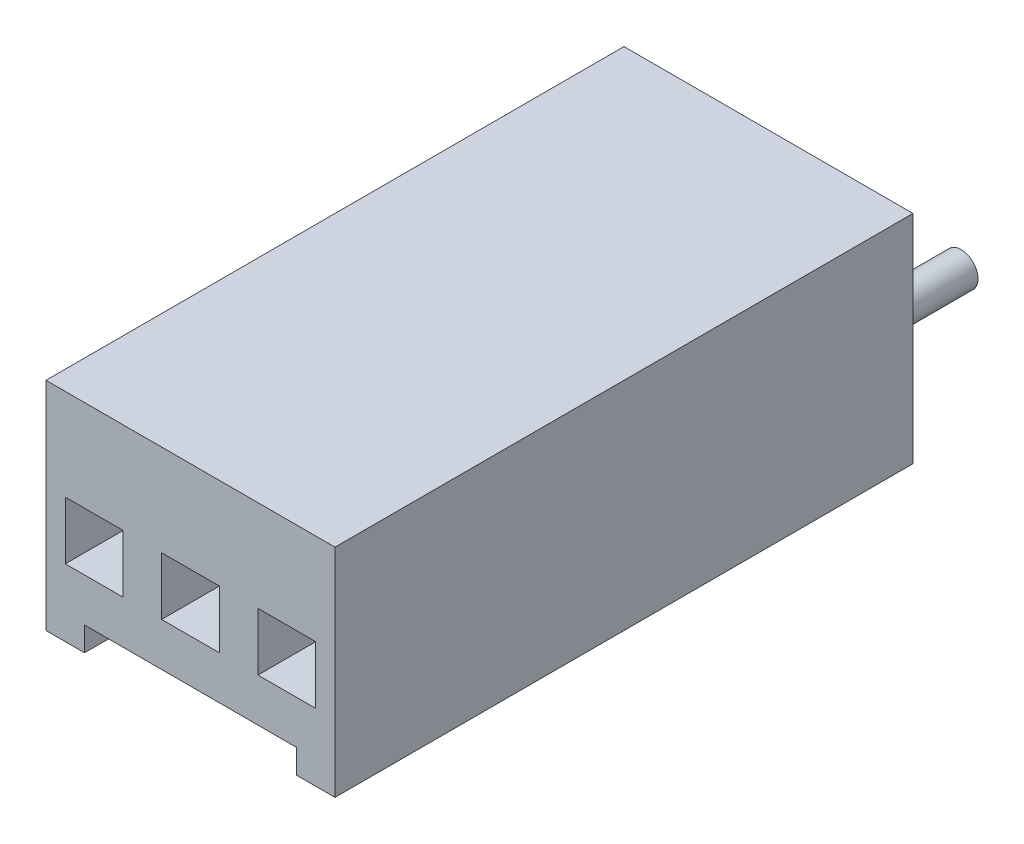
ISO-10303-21;
HEADER;
FILE_DESCRIPTION(('STEP AP214'),'2;1');
FILE_NAME('part.step','',(''),(''),'','','');
FILE_SCHEMA(('AUTOMOTIVE_DESIGN { 1 0 10303 214 1 1 1 1 }'));
ENDSEC;
DATA;
#1=APPLICATION_CONTEXT('core data for automotive mechanical design processes');
#2=APPLICATION_PROTOCOL_DEFINITION('international standard','automotive_design',2000,#1);
#3=PRODUCT_CONTEXT('',#1,'mechanical');
#4=PRODUCT('Part','Part','',(#3));
#5=PRODUCT_RELATED_PRODUCT_CATEGORY('part','',(#4));
#6=PRODUCT_DEFINITION_FORMATION('','',#4);
#7=PRODUCT_DEFINITION_CONTEXT('part definition',#1,'design');
#8=PRODUCT_DEFINITION('design','',#6,#7);
#9=PRODUCT_DEFINITION_SHAPE('','',#8);
#10=(LENGTH_UNIT() NAMED_UNIT(*) SI_UNIT(.MILLI.,.METRE.));
#11=(NAMED_UNIT(*) PLANE_ANGLE_UNIT() SI_UNIT($,.RADIAN.));
#12=(NAMED_UNIT(*) SI_UNIT($,.STERADIAN.) SOLID_ANGLE_UNIT());
#13=UNCERTAINTY_MEASURE_WITH_UNIT(LENGTH_MEASURE(1.E-05),#10,'distance_accuracy_value','');
#14=(GEOMETRIC_REPRESENTATION_CONTEXT(3) GLOBAL_UNCERTAINTY_ASSIGNED_CONTEXT((#13)) GLOBAL_UNIT_ASSIGNED_CONTEXT((#10,
#11,#12)) REPRESENTATION_CONTEXT('',''));
#15=CARTESIAN_POINT('',(0.,0.,0.));
#16=DIRECTION('',(0.,0.,1.));
#17=DIRECTION('',(1.,0.,0.));
#18=AXIS2_PLACEMENT_3D('',#15,#16,#17);
#19=CARTESIAN_POINT('',(-1.27,-1.905,15.24));
#20=DIRECTION('',(0.,1.,0.));
#21=DIRECTION('',(0.,0.,1.));
#22=AXIS2_PLACEMENT_3D('',#19,#20,#21);
#23=PLANE('',#22);
#24=DIRECTION('',(0.,0.,-1.));
#25=VECTOR('',#24,1.);
#26=CARTESIAN_POINT('',(5.334,-1.905,15.24));
#27=LINE('',#26,#25);
#28=CARTESIAN_POINT('',(5.334,-1.905,15.24));
#29=VERTEX_POINT('',#28);
#30=CARTESIAN_POINT('',(5.334,-1.905,2.54));
#31=VERTEX_POINT('',#30);
#32=EDGE_CURVE('E290',#29,#31,#27,.T.);
#33=ORIENTED_EDGE('',*,*,#32,.F.);
#34=DIRECTION('',(1.,0.,0.));
#35=VECTOR('',#34,1.);
#36=CARTESIAN_POINT('',(-1.27,-1.905,15.24));
#37=LINE('',#36,#35);
#38=CARTESIAN_POINT('',(-0.253999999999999,-1.905,15.24));
#39=VERTEX_POINT('',#38);
#40=EDGE_CURVE('E332',#39,#29,#37,.T.);
#41=ORIENTED_EDGE('',*,*,#40,.F.);
#42=DIRECTION('',(0.,0.,1.));
#43=VECTOR('',#42,1.);
#44=CARTESIAN_POINT('',(-0.254,-1.905,15.24));
#45=LINE('',#44,#43);
#46=CARTESIAN_POINT('',(-0.253999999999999,-1.905,2.54));
#47=VERTEX_POINT('',#46);
#48=EDGE_CURVE('E307',#47,#39,#45,.T.);
#49=ORIENTED_EDGE('',*,*,#48,.F.);
#50=DIRECTION('',(1.,0.,0.));
#51=VECTOR('',#50,1.);
#52=CARTESIAN_POINT('',(-1.27,-1.905,2.54));
#53=LINE('',#52,#51);
#54=CARTESIAN_POINT('',(0.,-1.905,2.54));
#55=VERTEX_POINT('',#54);
#56=EDGE_CURVE('E333',#47,#55,#53,.T.);
#57=ORIENTED_EDGE('',*,*,#56,.T.);
#58=DIRECTION('',(0.,0.,-1.));
#59=VECTOR('',#58,1.);
#60=CARTESIAN_POINT('',(0.,-1.905,10.16));
#61=LINE('',#60,#59);
#62=CARTESIAN_POINT('',(0.,-1.905,10.16));
#63=VERTEX_POINT('',#62);
#64=EDGE_CURVE('E356',#63,#55,#61,.T.);
#65=ORIENTED_EDGE('',*,*,#64,.F.);
#66=DIRECTION('',(-1.,0.,0.));
#67=VECTOR('',#66,1.);
#68=CARTESIAN_POINT('',(0.,-1.905,10.16));
#69=LINE('',#68,#67);
#70=CARTESIAN_POINT('',(5.08,-1.905,10.16));
#71=VERTEX_POINT('',#70);
#72=EDGE_CURVE('E353',#71,#63,#69,.T.);
#73=ORIENTED_EDGE('',*,*,#72,.F.);
#74=DIRECTION('',(0.,0.,-1.));
#75=VECTOR('',#74,1.);
#76=CARTESIAN_POINT('',(5.08,-1.905,10.16));
#77=LINE('',#76,#75);
#78=CARTESIAN_POINT('',(5.08,-1.905,2.54));
#79=VERTEX_POINT('',#78);
#80=EDGE_CURVE('E472',#71,#79,#77,.T.);
#81=ORIENTED_EDGE('',*,*,#80,.T.);
#82=EDGE_CURVE('E328',#79,#31,#53,.T.);
#83=ORIENTED_EDGE('',*,*,#82,.T.);
#84=EDGE_LOOP('',(#33,#41,#49,#57,#65,#73,#81,#83));
#85=FACE_BOUND('',#84,.T.);
#86=ADVANCED_FACE('F33',(#85),#23,.F.);
#87=CARTESIAN_POINT('',(-1.27,-2.54,2.54));
#88=DIRECTION('',(0.,0.,1.));
#89=DIRECTION('',(1.,0.,0.));
#90=AXIS2_PLACEMENT_3D('',#87,#88,#89);
#91=PLANE('',#90);
#92=DIRECTION('',(1.,0.,0.));
#93=VECTOR('',#92,1.);
#94=CARTESIAN_POINT('',(-1.27,-2.54,2.54));
#95=LINE('',#94,#93);
#96=CARTESIAN_POINT('',(5.08,-2.54,2.54));
#97=VERTEX_POINT('',#96);
#98=CARTESIAN_POINT('',(5.334,-2.54,2.54));
#99=VERTEX_POINT('',#98);
#100=EDGE_CURVE('E459',#97,#99,#95,.T.);
#101=ORIENTED_EDGE('',*,*,#100,.T.);
#102=DIRECTION('',(0.,1.,0.));
#103=VECTOR('',#102,1.);
#104=CARTESIAN_POINT('',(5.334,-2.54,2.54));
#105=LINE('',#104,#103);
#106=EDGE_CURVE('E304',#99,#31,#105,.T.);
#107=ORIENTED_EDGE('',*,*,#106,.T.);
#108=ORIENTED_EDGE('',*,*,#82,.F.);
#109=DIRECTION('',(0.,1.,0.));
#110=VECTOR('',#109,1.);
#111=CARTESIAN_POINT('',(5.08,-2.54,2.54));
#112=LINE('',#111,#110);
#113=EDGE_CURVE('E348',#97,#79,#112,.T.);
#114=ORIENTED_EDGE('',*,*,#113,.F.);
#115=EDGE_LOOP('',(#101,#107,#108,#114));
#116=FACE_BOUND('',#115,.T.);
#117=ADVANCED_FACE('F406',(#116),#91,.T.);
#118=ORIENTED_EDGE('',*,*,#56,.F.);
#119=DIRECTION('',(0.,1.,0.));
#120=VECTOR('',#119,1.);
#121=CARTESIAN_POINT('',(-0.253999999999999,-2.54,2.54));
#122=LINE('',#121,#120);
#123=CARTESIAN_POINT('',(-0.253999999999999,-2.54,2.54));
#124=VERTEX_POINT('',#123);
#125=EDGE_CURVE('E317',#124,#47,#122,.T.);
#126=ORIENTED_EDGE('',*,*,#125,.F.);
#127=CARTESIAN_POINT('',(0.,-2.54,2.54));
#128=VERTEX_POINT('',#127);
#129=EDGE_CURVE('E37',#124,#128,#95,.T.);
#130=ORIENTED_EDGE('',*,*,#129,.T.);
#131=DIRECTION('',(0.,-1.,0.));
#132=VECTOR('',#131,1.);
#133=CARTESIAN_POINT('',(0.,-2.54,2.54));
#134=LINE('',#133,#132);
#135=EDGE_CURVE('E342',#55,#128,#134,.T.);
#136=ORIENTED_EDGE('',*,*,#135,.F.);
#137=EDGE_LOOP('',(#118,#126,#130,#136));
#138=FACE_BOUND('',#137,.T.);
#139=ADVANCED_FACE('F378',(#138),#91,.T.);
#140=CARTESIAN_POINT('',(-1.27,-2.54,0.));
#141=DIRECTION('',(0.,0.,1.));
#142=DIRECTION('',(1.,0.,0.));
#143=AXIS2_PLACEMENT_3D('',#140,#141,#142);
#144=PLANE('',#143);
#145=CARTESIAN_POINT('',(2.54,0.,0.));
#146=DIRECTION('',(0.,0.,1.));
#147=DIRECTION('',(1.,0.,0.));
#148=AXIS2_PLACEMENT_3D('',#145,#146,#147);
#149=CIRCLE('',#148,0.4445);
#150=CARTESIAN_POINT('',(2.9845,0.,0.));
#151=VERTEX_POINT('',#150);
#152=EDGE_CURVE('E43',#151,#151,#149,.F.);
#153=ORIENTED_EDGE('',*,*,#152,.F.);
#154=EDGE_LOOP('',(#153));
#155=FACE_BOUND('',#154,.T.);
#156=DIRECTION('',(0.,-1.,0.));
#157=VECTOR('',#156,1.);
#158=CARTESIAN_POINT('',(-1.27,3.17499999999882,0.));
#159=LINE('',#158,#157);
#160=CARTESIAN_POINT('',(-1.27,3.17499999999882,0.));
#161=VERTEX_POINT('',#160);
#162=CARTESIAN_POINT('',(-1.27,-2.54,0.));
#163=VERTEX_POINT('',#162);
#164=EDGE_CURVE('E384',#161,#163,#159,.T.);
#165=ORIENTED_EDGE('',*,*,#164,.F.);
#166=DIRECTION('',(-1.,0.,0.));
#167=VECTOR('',#166,1.);
#168=CARTESIAN_POINT('',(-1.27,3.17499999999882,0.));
#169=LINE('',#168,#167);
#170=CARTESIAN_POINT('',(6.35,3.17499999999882,0.));
#171=VERTEX_POINT('',#170);
#172=EDGE_CURVE('E457',#171,#161,#169,.T.);
#173=ORIENTED_EDGE('',*,*,#172,.F.);
#174=DIRECTION('',(0.,1.,0.));
#175=VECTOR('',#174,1.);
#176=CARTESIAN_POINT('',(6.35,3.17499999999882,0.));
#177=LINE('',#176,#175);
#178=CARTESIAN_POINT('',(6.35,-2.54,0.));
#179=VERTEX_POINT('',#178);
#180=EDGE_CURVE('E451',#179,#171,#177,.T.);
#181=ORIENTED_EDGE('',*,*,#180,.F.);
#182=DIRECTION('',(1.,0.,0.));
#183=VECTOR('',#182,1.);
#184=CARTESIAN_POINT('',(-1.27,-2.54,0.));
#185=LINE('',#184,#183);
#186=EDGE_CURVE('E446',#163,#179,#185,.T.);
#187=ORIENTED_EDGE('',*,*,#186,.F.);
#188=EDGE_LOOP('',(#165,#173,#181,#187));
#189=FACE_BOUND('',#188,.T.);
#190=CARTESIAN_POINT('',(0.,0.,0.));
#191=DIRECTION('',(0.,0.,1.));
#192=DIRECTION('',(1.,0.,0.));
#193=AXIS2_PLACEMENT_3D('',#190,#191,#192);
#194=CIRCLE('',#193,0.4445);
#195=CARTESIAN_POINT('',(0.4445,0.,0.));
#196=VERTEX_POINT('',#195);
#197=EDGE_CURVE('E366',#196,#196,#194,.F.);
#198=ORIENTED_EDGE('',*,*,#197,.F.);
#199=EDGE_LOOP('',(#198));
#200=FACE_BOUND('',#199,.T.);
#201=CARTESIAN_POINT('',(5.08,0.,0.));
#202=DIRECTION('',(0.,0.,1.));
#203=DIRECTION('',(1.,0.,0.));
#204=AXIS2_PLACEMENT_3D('',#201,#202,#203);
#205=CIRCLE('',#204,0.4445);
#206=CARTESIAN_POINT('',(5.5245,0.,0.));
#207=VERTEX_POINT('',#206);
#208=EDGE_CURVE('E11',#207,#207,#205,.F.);
#209=ORIENTED_EDGE('',*,*,#208,.F.);
#210=EDGE_LOOP('',(#209));
#211=FACE_BOUND('',#210,.T.);
#212=ADVANCED_FACE('F375',(#155,#189,#200,#211),#144,.F.);
#213=CARTESIAN_POINT('',(-1.27,3.17499999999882,2.54));
#214=DIRECTION('',(1.,0.,0.));
#215=DIRECTION('',(0.,1.,0.));
#216=AXIS2_PLACEMENT_3D('',#213,#214,#215);
#217=PLANE('',#216);
#218=DIRECTION('',(0.,0.,-1.));
#219=VECTOR('',#218,1.);
#220=CARTESIAN_POINT('',(-1.27,-2.54,2.54));
#221=LINE('',#220,#219);
#222=CARTESIAN_POINT('',(-1.27,-2.54,15.24));
#223=VERTEX_POINT('',#222);
#224=EDGE_CURVE('E369',#223,#163,#221,.T.);
#225=ORIENTED_EDGE('',*,*,#224,.F.);
#226=DIRECTION('',(0.,-1.,0.));
#227=VECTOR('',#226,1.);
#228=CARTESIAN_POINT('',(-1.27,3.17499999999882,15.24));
#229=LINE('',#228,#227);
#230=CARTESIAN_POINT('',(-1.27,3.17499999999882,15.24));
#231=VERTEX_POINT('',#230);
#232=EDGE_CURVE('E329',#231,#223,#229,.T.);
#233=ORIENTED_EDGE('',*,*,#232,.F.);
#234=DIRECTION('',(0.,0.,-1.));
#235=VECTOR('',#234,1.);
#236=CARTESIAN_POINT('',(-1.27,3.17499999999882,2.54));
#237=LINE('',#236,#235);
#238=EDGE_CURVE('E463',#231,#161,#237,.T.);
#239=ORIENTED_EDGE('',*,*,#238,.T.);
#240=ORIENTED_EDGE('',*,*,#164,.T.);
#241=EDGE_LOOP('',(#225,#233,#239,#240));
#242=FACE_BOUND('',#241,.T.);
#243=ADVANCED_FACE('F35',(#242),#217,.F.);
#244=CARTESIAN_POINT('',(-1.27,-2.54,2.54));
#245=DIRECTION('',(0.,1.,0.));
#246=DIRECTION('',(0.,0.,1.));
#247=AXIS2_PLACEMENT_3D('',#244,#245,#246);
#248=PLANE('',#247);
#249=ORIENTED_EDGE('',*,*,#186,.T.);
#250=DIRECTION('',(0.,0.,-1.));
#251=VECTOR('',#250,1.);
#252=CARTESIAN_POINT('',(6.35,-2.54,2.54));
#253=LINE('',#252,#251);
#254=CARTESIAN_POINT('',(6.35,-2.54,15.24));
#255=VERTEX_POINT('',#254);
#256=EDGE_CURVE('E448',#255,#179,#253,.T.);
#257=ORIENTED_EDGE('',*,*,#256,.F.);
#258=DIRECTION('',(-1.,0.,0.));
#259=VECTOR('',#258,1.);
#260=CARTESIAN_POINT('',(5.334,-2.54,15.24));
#261=LINE('',#260,#259);
#262=CARTESIAN_POINT('',(5.334,-2.54,15.24));
#263=VERTEX_POINT('',#262);
#264=EDGE_CURVE('E299',#255,#263,#261,.T.);
#265=ORIENTED_EDGE('',*,*,#264,.T.);
#266=DIRECTION('',(0.,0.,-1.));
#267=VECTOR('',#266,1.);
#268=CARTESIAN_POINT('',(5.334,-2.54,15.24));
#269=LINE('',#268,#267);
#270=EDGE_CURVE('E297',#263,#99,#269,.T.);
#271=ORIENTED_EDGE('',*,*,#270,.T.);
#272=ORIENTED_EDGE('',*,*,#100,.F.);
#273=DIRECTION('',(0.,0.,-1.));
#274=VECTOR('',#273,1.);
#275=CARTESIAN_POINT('',(5.08,-2.54,10.16));
#276=LINE('',#275,#274);
#277=CARTESIAN_POINT('',(5.08,-2.54,10.16));
#278=VERTEX_POINT('',#277);
#279=EDGE_CURVE('E476',#278,#97,#276,.T.);
#280=ORIENTED_EDGE('',*,*,#279,.F.);
#281=DIRECTION('',(1.,0.,0.));
#282=VECTOR('',#281,1.);
#283=CARTESIAN_POINT('',(0.,-2.54,10.16));
#284=LINE('',#283,#282);
#285=CARTESIAN_POINT('',(0.,-2.54,10.16));
#286=VERTEX_POINT('',#285);
#287=EDGE_CURVE('E347',#286,#278,#284,.T.);
#288=ORIENTED_EDGE('',*,*,#287,.F.);
#289=DIRECTION('',(0.,0.,-1.));
#290=VECTOR('',#289,1.);
#291=CARTESIAN_POINT('',(0.,-2.54,10.16));
#292=LINE('',#291,#290);
#293=EDGE_CURVE('E474',#286,#128,#292,.T.);
#294=ORIENTED_EDGE('',*,*,#293,.T.);
#295=ORIENTED_EDGE('',*,*,#129,.F.);
#296=DIRECTION('',(0.,0.,1.));
#297=VECTOR('',#296,1.);
#298=CARTESIAN_POINT('',(-0.254,-2.54,15.24));
#299=LINE('',#298,#297);
#300=CARTESIAN_POINT('',(-0.254,-2.54,15.24));
#301=VERTEX_POINT('',#300);
#302=EDGE_CURVE('E308',#124,#301,#299,.T.);
#303=ORIENTED_EDGE('',*,*,#302,.T.);
#304=DIRECTION('',(-1.,0.,0.));
#305=VECTOR('',#304,1.);
#306=CARTESIAN_POINT('',(-1.27,-2.54,15.24));
#307=LINE('',#306,#305);
#308=EDGE_CURVE('E310',#301,#223,#307,.T.);
#309=ORIENTED_EDGE('',*,*,#308,.T.);
#310=ORIENTED_EDGE('',*,*,#224,.T.);
#311=EDGE_LOOP('',(#249,#257,#265,#271,#272,#280,#288,#294,#295,#303,#309,#310));
#312=FACE_BOUND('',#311,.T.);
#313=ADVANCED_FACE('F437',(#312),#248,.F.);
#314=CARTESIAN_POINT('',(6.35,3.17499999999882,2.54));
#315=DIRECTION('',(-1.,0.,0.));
#316=DIRECTION('',(0.,0.,1.));
#317=AXIS2_PLACEMENT_3D('',#314,#315,#316);
#318=PLANE('',#317);
#319=ORIENTED_EDGE('',*,*,#180,.T.);
#320=DIRECTION('',(0.,0.,-1.));
#321=VECTOR('',#320,1.);
#322=CARTESIAN_POINT('',(6.35,3.17499999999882,2.54));
#323=LINE('',#322,#321);
#324=CARTESIAN_POINT('',(6.35,3.17499999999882,15.24));
#325=VERTEX_POINT('',#324);
#326=EDGE_CURVE('E455',#325,#171,#323,.T.);
#327=ORIENTED_EDGE('',*,*,#326,.F.);
#328=DIRECTION('',(0.,1.,0.));
#329=VECTOR('',#328,1.);
#330=CARTESIAN_POINT('',(6.35,3.17499999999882,15.24));
#331=LINE('',#330,#329);
#332=EDGE_CURVE('E336',#255,#325,#331,.T.);
#333=ORIENTED_EDGE('',*,*,#332,.F.);
#334=ORIENTED_EDGE('',*,*,#256,.T.);
#335=EDGE_LOOP('',(#319,#327,#333,#334));
#336=FACE_BOUND('',#335,.T.);
#337=ADVANCED_FACE('F434',(#336),#318,.F.);
#338=CARTESIAN_POINT('',(-1.27,3.17499999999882,2.54));
#339=DIRECTION('',(0.,-1.,0.));
#340=DIRECTION('',(0.,0.,-1.));
#341=AXIS2_PLACEMENT_3D('',#338,#339,#340);
#342=PLANE('',#341);
#343=ORIENTED_EDGE('',*,*,#172,.T.);
#344=ORIENTED_EDGE('',*,*,#238,.F.);
#345=DIRECTION('',(-1.,0.,0.));
#346=VECTOR('',#345,1.);
#347=CARTESIAN_POINT('',(-1.27,3.17499999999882,15.24));
#348=LINE('',#347,#346);
#349=EDGE_CURVE('E339',#325,#231,#348,.T.);
#350=ORIENTED_EDGE('',*,*,#349,.F.);
#351=ORIENTED_EDGE('',*,*,#326,.T.);
#352=EDGE_LOOP('',(#343,#344,#350,#351));
#353=FACE_BOUND('',#352,.T.);
#354=ADVANCED_FACE('F429',(#353),#342,.F.);
#355=CARTESIAN_POINT('',(0.,-2.54,10.16));
#356=DIRECTION('',(1.,0.,0.));
#357=DIRECTION('',(0.,0.,-1.));
#358=AXIS2_PLACEMENT_3D('',#355,#356,#357);
#359=PLANE('',#358);
#360=ORIENTED_EDGE('',*,*,#135,.T.);
#361=ORIENTED_EDGE('',*,*,#293,.F.);
#362=DIRECTION('',(0.,-1.,0.));
#363=VECTOR('',#362,1.);
#364=CARTESIAN_POINT('',(0.,-2.54,10.16));
#365=LINE('',#364,#363);
#366=EDGE_CURVE('E344',#63,#286,#365,.T.);
#367=ORIENTED_EDGE('',*,*,#366,.F.);
#368=ORIENTED_EDGE('',*,*,#64,.T.);
#369=EDGE_LOOP('',(#360,#361,#367,#368));
#370=FACE_BOUND('',#369,.T.);
#371=ADVANCED_FACE('F426',(#370),#359,.F.);
#372=CARTESIAN_POINT('',(5.08,-2.54,10.16));
#373=DIRECTION('',(-1.,0.,0.));
#374=DIRECTION('',(0.,0.,1.));
#375=AXIS2_PLACEMENT_3D('',#372,#373,#374);
#376=PLANE('',#375);
#377=ORIENTED_EDGE('',*,*,#113,.T.);
#378=ORIENTED_EDGE('',*,*,#80,.F.);
#379=DIRECTION('',(0.,1.,0.));
#380=VECTOR('',#379,1.);
#381=CARTESIAN_POINT('',(5.08,-2.54,10.16));
#382=LINE('',#381,#380);
#383=EDGE_CURVE('E350',#278,#71,#382,.T.);
#384=ORIENTED_EDGE('',*,*,#383,.F.);
#385=ORIENTED_EDGE('',*,*,#279,.T.);
#386=EDGE_LOOP('',(#377,#378,#384,#385));
#387=FACE_BOUND('',#386,.T.);
#388=ADVANCED_FACE('F422',(#387),#376,.F.);
#389=CARTESIAN_POINT('',(0.,-1.905,10.16));
#390=DIRECTION('',(0.,0.,-1.));
#391=DIRECTION('',(-1.,0.,0.));
#392=AXIS2_PLACEMENT_3D('',#389,#390,#391);
#393=PLANE('',#392);
#394=ORIENTED_EDGE('',*,*,#366,.T.);
#395=ORIENTED_EDGE('',*,*,#287,.T.);
#396=ORIENTED_EDGE('',*,*,#383,.T.);
#397=ORIENTED_EDGE('',*,*,#72,.T.);
#398=EDGE_LOOP('',(#394,#395,#396,#397));
#399=FACE_BOUND('',#398,.T.);
#400=ADVANCED_FACE('F419',(#399),#393,.F.);
#401=CARTESIAN_POINT('',(-1.27,-1.905,15.24));
#402=DIRECTION('',(0.,0.,1.));
#403=DIRECTION('',(1.,0.,0.));
#404=AXIS2_PLACEMENT_3D('',#401,#402,#403);
#405=PLANE('',#404);
#406=DIRECTION('',(0.,-1.,0.));
#407=VECTOR('',#406,1.);
#408=CARTESIAN_POINT('',(4.318,-0.762,15.24));
#409=LINE('',#408,#407);
#410=CARTESIAN_POINT('',(4.318,0.762,15.24));
#411=VERTEX_POINT('',#410);
#412=CARTESIAN_POINT('',(4.318,-0.762,15.24));
#413=VERTEX_POINT('',#412);
#414=EDGE_CURVE('E50',#411,#413,#409,.T.);
#415=ORIENTED_EDGE('',*,*,#414,.F.);
#416=DIRECTION('',(-1.,0.,0.));
#417=VECTOR('',#416,1.);
#418=CARTESIAN_POINT('',(4.318,0.762,15.24));
#419=LINE('',#418,#417);
#420=CARTESIAN_POINT('',(5.842,0.762,15.24));
#421=VERTEX_POINT('',#420);
#422=EDGE_CURVE('E216',#421,#411,#419,.T.);
#423=ORIENTED_EDGE('',*,*,#422,.F.);
#424=DIRECTION('',(0.,1.,0.));
#425=VECTOR('',#424,1.);
#426=CARTESIAN_POINT('',(5.842,-0.762,15.24));
#427=LINE('',#426,#425);
#428=CARTESIAN_POINT('',(5.842,-0.762,15.24));
#429=VERTEX_POINT('',#428);
#430=EDGE_CURVE('E219',#429,#421,#427,.T.);
#431=ORIENTED_EDGE('',*,*,#430,.F.);
#432=DIRECTION('',(1.,0.,0.));
#433=VECTOR('',#432,1.);
#434=CARTESIAN_POINT('',(4.318,-0.762,15.24));
#435=LINE('',#434,#433);
#436=EDGE_CURVE('E225',#413,#429,#435,.T.);
#437=ORIENTED_EDGE('',*,*,#436,.F.);
#438=EDGE_LOOP('',(#415,#423,#431,#437));
#439=FACE_BOUND('',#438,.T.);
#440=DIRECTION('',(0.,-1.,0.));
#441=VECTOR('',#440,1.);
#442=CARTESIAN_POINT('',(1.778,0.762,15.24));
#443=LINE('',#442,#441);
#444=CARTESIAN_POINT('',(1.778,0.762,15.24));
#445=VERTEX_POINT('',#444);
#446=CARTESIAN_POINT('',(1.778,-0.762,15.24));
#447=VERTEX_POINT('',#446);
#448=EDGE_CURVE('E58',#445,#447,#443,.T.);
#449=ORIENTED_EDGE('',*,*,#448,.F.);
#450=DIRECTION('',(-1.,0.,0.));
#451=VECTOR('',#450,1.);
#452=CARTESIAN_POINT('',(1.778,0.762,15.24));
#453=LINE('',#452,#451);
#454=CARTESIAN_POINT('',(3.302,0.762,15.24));
#455=VERTEX_POINT('',#454);
#456=EDGE_CURVE('E238',#455,#445,#453,.T.);
#457=ORIENTED_EDGE('',*,*,#456,.F.);
#458=DIRECTION('',(0.,1.,0.));
#459=VECTOR('',#458,1.);
#460=CARTESIAN_POINT('',(3.302,0.762,15.24));
#461=LINE('',#460,#459);
#462=CARTESIAN_POINT('',(3.302,-0.762,15.24));
#463=VERTEX_POINT('',#462);
#464=EDGE_CURVE('E252',#463,#455,#461,.T.);
#465=ORIENTED_EDGE('',*,*,#464,.F.);
#466=DIRECTION('',(1.,0.,0.));
#467=VECTOR('',#466,1.);
#468=CARTESIAN_POINT('',(1.778,-0.762,15.24));
#469=LINE('',#468,#467);
#470=EDGE_CURVE('E249',#447,#463,#469,.T.);
#471=ORIENTED_EDGE('',*,*,#470,.F.);
#472=EDGE_LOOP('',(#449,#457,#465,#471));
#473=FACE_BOUND('',#472,.T.);
#474=DIRECTION('',(0.,-1.,0.));
#475=VECTOR('',#474,1.);
#476=CARTESIAN_POINT('',(-0.762,0.762,15.24));
#477=LINE('',#476,#475);
#478=CARTESIAN_POINT('',(-0.762,0.762,15.24));
#479=VERTEX_POINT('',#478);
#480=CARTESIAN_POINT('',(-0.762,-0.762,15.24));
#481=VERTEX_POINT('',#480);
#482=EDGE_CURVE('E259',#479,#481,#477,.T.);
#483=ORIENTED_EDGE('',*,*,#482,.F.);
#484=DIRECTION('',(-1.,0.,0.));
#485=VECTOR('',#484,1.);
#486=CARTESIAN_POINT('',(-0.762,0.762,15.24));
#487=LINE('',#486,#485);
#488=CARTESIAN_POINT('',(0.762,0.762,15.24));
#489=VERTEX_POINT('',#488);
#490=EDGE_CURVE('E269',#489,#479,#487,.T.);
#491=ORIENTED_EDGE('',*,*,#490,.F.);
#492=DIRECTION('',(0.,1.,0.));
#493=VECTOR('',#492,1.);
#494=CARTESIAN_POINT('',(0.762,0.762,15.24));
#495=LINE('',#494,#493);
#496=CARTESIAN_POINT('',(0.762,-0.762,15.24));
#497=VERTEX_POINT('',#496);
#498=EDGE_CURVE('E283',#497,#489,#495,.T.);
#499=ORIENTED_EDGE('',*,*,#498,.F.);
#500=DIRECTION('',(1.,0.,0.));
#501=VECTOR('',#500,1.);
#502=CARTESIAN_POINT('',(-0.762,-0.762,15.24));
#503=LINE('',#502,#501);
#504=EDGE_CURVE('E280',#481,#497,#503,.T.);
#505=ORIENTED_EDGE('',*,*,#504,.F.);
#506=EDGE_LOOP('',(#483,#491,#499,#505));
#507=FACE_BOUND('',#506,.T.);
#508=ORIENTED_EDGE('',*,*,#232,.T.);
#509=ORIENTED_EDGE('',*,*,#308,.F.);
#510=DIRECTION('',(0.,1.,0.));
#511=VECTOR('',#510,1.);
#512=CARTESIAN_POINT('',(-0.254,-2.54,15.24));
#513=LINE('',#512,#511);
#514=EDGE_CURVE('E313',#301,#39,#513,.T.);
#515=ORIENTED_EDGE('',*,*,#514,.T.);
#516=ORIENTED_EDGE('',*,*,#40,.T.);
#517=DIRECTION('',(0.,1.,0.));
#518=VECTOR('',#517,1.);
#519=CARTESIAN_POINT('',(5.334,-2.54,15.24));
#520=LINE('',#519,#518);
#521=EDGE_CURVE('E301',#263,#29,#520,.T.);
#522=ORIENTED_EDGE('',*,*,#521,.F.);
#523=ORIENTED_EDGE('',*,*,#264,.F.);
#524=ORIENTED_EDGE('',*,*,#332,.T.);
#525=ORIENTED_EDGE('',*,*,#349,.T.);
#526=EDGE_LOOP('',(#508,#509,#515,#516,#522,#523,#524,#525));
#527=FACE_BOUND('',#526,.T.);
#528=ADVANCED_FACE('F417',(#439,#473,#507,#527),#405,.T.);
#529=CARTESIAN_POINT('',(0.,0.,-2.54));
#530=DIRECTION('',(0.,0.,1.));
#531=DIRECTION('',(1.,0.,0.));
#532=AXIS2_PLACEMENT_3D('',#529,#530,#531);
#533=CYLINDRICAL_SURFACE('',#532,0.4445);
#534=CARTESIAN_POINT('',(0.,0.,-2.54));
#535=DIRECTION('',(0.,0.,-1.));
#536=DIRECTION('',(-1.,0.,0.));
#537=AXIS2_PLACEMENT_3D('',#534,#535,#536);
#538=CIRCLE('',#537,0.4445);
#539=CARTESIAN_POINT('',(-0.4445,0.,-2.54));
#540=VERTEX_POINT('',#539);
#541=EDGE_CURVE('E325',#540,#540,#538,.T.);
#542=ORIENTED_EDGE('',*,*,#541,.F.);
#543=EDGE_LOOP('',(#542));
#544=FACE_BOUND('',#543,.T.);
#545=ORIENTED_EDGE('',*,*,#197,.T.);
#546=EDGE_LOOP('',(#545));
#547=FACE_BOUND('',#546,.T.);
#548=ADVANCED_FACE('F566',(#544,#547),#533,.T.);
#549=CARTESIAN_POINT('',(0.,0.,-2.54));
#550=DIRECTION('',(0.,0.,-1.));
#551=DIRECTION('',(-1.,0.,0.));
#552=AXIS2_PLACEMENT_3D('',#549,#550,#551);
#553=PLANE('',#552);
#554=ORIENTED_EDGE('',*,*,#541,.T.);
#555=EDGE_LOOP('',(#554));
#556=FACE_BOUND('',#555,.T.);
#557=ADVANCED_FACE('F733',(#556),#553,.T.);
#558=CARTESIAN_POINT('',(2.54,0.,-2.54));
#559=DIRECTION('',(0.,0.,1.));
#560=DIRECTION('',(1.,0.,0.));
#561=AXIS2_PLACEMENT_3D('',#558,#559,#560);
#562=CYLINDRICAL_SURFACE('',#561,0.4445);
#563=CARTESIAN_POINT('',(2.54,0.,-2.54));
#564=DIRECTION('',(0.,0.,-1.));
#565=DIRECTION('',(-1.,0.,0.));
#566=AXIS2_PLACEMENT_3D('',#563,#564,#565);
#567=CIRCLE('',#566,0.4445);
#568=CARTESIAN_POINT('',(2.0955,0.,-2.54));
#569=VERTEX_POINT('',#568);
#570=EDGE_CURVE('E322',#569,#569,#567,.T.);
#571=ORIENTED_EDGE('',*,*,#570,.F.);
#572=EDGE_LOOP('',(#571));
#573=FACE_BOUND('',#572,.T.);
#574=ORIENTED_EDGE('',*,*,#152,.T.);
#575=EDGE_LOOP('',(#574));
#576=FACE_BOUND('',#575,.T.);
#577=ADVANCED_FACE('F373',(#573,#576),#562,.T.);
#578=CARTESIAN_POINT('',(2.54,0.,-2.54));
#579=DIRECTION('',(0.,0.,-1.));
#580=DIRECTION('',(-1.,0.,0.));
#581=AXIS2_PLACEMENT_3D('',#578,#579,#580);
#582=PLANE('',#581);
#583=ORIENTED_EDGE('',*,*,#570,.T.);
#584=EDGE_LOOP('',(#583));
#585=FACE_BOUND('',#584,.T.);
#586=ADVANCED_FACE('F392',(#585),#582,.T.);
#587=CARTESIAN_POINT('',(5.08,0.,-2.54));
#588=DIRECTION('',(0.,0.,1.));
#589=DIRECTION('',(1.,0.,0.));
#590=AXIS2_PLACEMENT_3D('',#587,#588,#589);
#591=CYLINDRICAL_SURFACE('',#590,0.4445);
#592=CARTESIAN_POINT('',(5.08,0.,-2.54));
#593=DIRECTION('',(0.,0.,-1.));
#594=DIRECTION('',(-1.,0.,0.));
#595=AXIS2_PLACEMENT_3D('',#592,#593,#594);
#596=CIRCLE('',#595,0.4445);
#597=CARTESIAN_POINT('',(4.6355,0.,-2.54));
#598=VERTEX_POINT('',#597);
#599=EDGE_CURVE('E319',#598,#598,#596,.T.);
#600=ORIENTED_EDGE('',*,*,#599,.F.);
#601=EDGE_LOOP('',(#600));
#602=FACE_BOUND('',#601,.T.);
#603=ORIENTED_EDGE('',*,*,#208,.T.);
#604=EDGE_LOOP('',(#603));
#605=FACE_BOUND('',#604,.T.);
#606=ADVANCED_FACE('F389',(#602,#605),#591,.T.);
#607=CARTESIAN_POINT('',(5.08,0.,-2.54));
#608=DIRECTION('',(0.,0.,-1.));
#609=DIRECTION('',(-1.,0.,0.));
#610=AXIS2_PLACEMENT_3D('',#607,#608,#609);
#611=PLANE('',#610);
#612=ORIENTED_EDGE('',*,*,#599,.T.);
#613=EDGE_LOOP('',(#612));
#614=FACE_BOUND('',#613,.T.);
#615=ADVANCED_FACE('F391',(#614),#611,.T.);
#616=CARTESIAN_POINT('',(-0.254,-2.54,15.24));
#617=DIRECTION('',(-1.,0.,0.));
#618=DIRECTION('',(0.,0.,1.));
#619=AXIS2_PLACEMENT_3D('',#616,#617,#618);
#620=PLANE('',#619);
#621=ORIENTED_EDGE('',*,*,#48,.T.);
#622=ORIENTED_EDGE('',*,*,#514,.F.);
#623=ORIENTED_EDGE('',*,*,#302,.F.);
#624=ORIENTED_EDGE('',*,*,#125,.T.);
#625=EDGE_LOOP('',(#621,#622,#623,#624));
#626=FACE_BOUND('',#625,.T.);
#627=ADVANCED_FACE('F399',(#626),#620,.F.);
#628=CARTESIAN_POINT('',(5.334,-2.54,15.24));
#629=DIRECTION('',(1.,0.,0.));
#630=DIRECTION('',(0.,0.,-1.));
#631=AXIS2_PLACEMENT_3D('',#628,#629,#630);
#632=PLANE('',#631);
#633=ORIENTED_EDGE('',*,*,#32,.T.);
#634=ORIENTED_EDGE('',*,*,#106,.F.);
#635=ORIENTED_EDGE('',*,*,#270,.F.);
#636=ORIENTED_EDGE('',*,*,#521,.T.);
#637=EDGE_LOOP('',(#633,#634,#635,#636));
#638=FACE_BOUND('',#637,.T.);
#639=ADVANCED_FACE('F500',(#638),#632,.F.);
#640=CARTESIAN_POINT('',(-0.762,0.762,2.54));
#641=DIRECTION('',(-1.,0.,0.));
#642=DIRECTION('',(0.,0.,1.));
#643=AXIS2_PLACEMENT_3D('',#640,#641,#642);
#644=PLANE('',#643);
#645=ORIENTED_EDGE('',*,*,#482,.T.);
#646=DIRECTION('',(0.,0.,1.));
#647=VECTOR('',#646,1.);
#648=CARTESIAN_POINT('',(-0.762,-0.762,2.54));
#649=LINE('',#648,#647);
#650=CARTESIAN_POINT('',(-0.762,-0.762,2.54));
#651=VERTEX_POINT('',#650);
#652=EDGE_CURVE('E278',#651,#481,#649,.T.);
#653=ORIENTED_EDGE('',*,*,#652,.F.);
#654=DIRECTION('',(0.,-1.,0.));
#655=VECTOR('',#654,1.);
#656=CARTESIAN_POINT('',(-0.762,0.762,2.54));
#657=LINE('',#656,#655);
#658=CARTESIAN_POINT('',(-0.762,0.762,2.54));
#659=VERTEX_POINT('',#658);
#660=EDGE_CURVE('E265',#659,#651,#657,.T.);
#661=ORIENTED_EDGE('',*,*,#660,.F.);
#662=DIRECTION('',(0.,0.,1.));
#663=VECTOR('',#662,1.);
#664=CARTESIAN_POINT('',(-0.762,0.762,2.54));
#665=LINE('',#664,#663);
#666=EDGE_CURVE('E288',#659,#479,#665,.T.);
#667=ORIENTED_EDGE('',*,*,#666,.T.);
#668=EDGE_LOOP('',(#645,#653,#661,#667));
#669=FACE_BOUND('',#668,.T.);
#670=ADVANCED_FACE('F556',(#669),#644,.F.);
#671=CARTESIAN_POINT('',(-0.762,0.762,2.54));
#672=DIRECTION('',(0.,1.,0.));
#673=DIRECTION('',(0.,0.,1.));
#674=AXIS2_PLACEMENT_3D('',#671,#672,#673);
#675=PLANE('',#674);
#676=ORIENTED_EDGE('',*,*,#490,.T.);
#677=ORIENTED_EDGE('',*,*,#666,.F.);
#678=DIRECTION('',(-1.,0.,0.));
#679=VECTOR('',#678,1.);
#680=CARTESIAN_POINT('',(-0.762,0.762,2.54));
#681=LINE('',#680,#679);
#682=CARTESIAN_POINT('',(0.762,0.762,2.54));
#683=VERTEX_POINT('',#682);
#684=EDGE_CURVE('E275',#683,#659,#681,.T.);
#685=ORIENTED_EDGE('',*,*,#684,.F.);
#686=DIRECTION('',(0.,0.,1.));
#687=VECTOR('',#686,1.);
#688=CARTESIAN_POINT('',(0.762,0.762,2.54));
#689=LINE('',#688,#687);
#690=EDGE_CURVE('E291',#683,#489,#689,.T.);
#691=ORIENTED_EDGE('',*,*,#690,.T.);
#692=EDGE_LOOP('',(#676,#677,#685,#691));
#693=FACE_BOUND('',#692,.T.);
#694=ADVANCED_FACE('F574',(#693),#675,.F.);
#695=CARTESIAN_POINT('',(0.762,0.762,2.54));
#696=DIRECTION('',(1.,0.,0.));
#697=DIRECTION('',(0.,1.,0.));
#698=AXIS2_PLACEMENT_3D('',#695,#696,#697);
#699=PLANE('',#698);
#700=ORIENTED_EDGE('',*,*,#498,.T.);
#701=ORIENTED_EDGE('',*,*,#690,.F.);
#702=DIRECTION('',(0.,1.,0.));
#703=VECTOR('',#702,1.);
#704=CARTESIAN_POINT('',(0.762,0.762,2.54));
#705=LINE('',#704,#703);
#706=CARTESIAN_POINT('',(0.762,-0.762,2.54));
#707=VERTEX_POINT('',#706);
#708=EDGE_CURVE('E272',#707,#683,#705,.T.);
#709=ORIENTED_EDGE('',*,*,#708,.F.);
#710=DIRECTION('',(0.,0.,1.));
#711=VECTOR('',#710,1.);
#712=CARTESIAN_POINT('',(0.762,-0.762,2.54));
#713=LINE('',#712,#711);
#714=EDGE_CURVE('E293',#707,#497,#713,.T.);
#715=ORIENTED_EDGE('',*,*,#714,.T.);
#716=EDGE_LOOP('',(#700,#701,#709,#715));
#717=FACE_BOUND('',#716,.T.);
#718=ADVANCED_FACE('F584',(#717),#699,.F.);
#719=CARTESIAN_POINT('',(-0.762,-0.762,2.54));
#720=DIRECTION('',(0.,-1.,0.));
#721=DIRECTION('',(0.,0.,-1.));
#722=AXIS2_PLACEMENT_3D('',#719,#720,#721);
#723=PLANE('',#722);
#724=ORIENTED_EDGE('',*,*,#504,.T.);
#725=ORIENTED_EDGE('',*,*,#714,.F.);
#726=DIRECTION('',(1.,0.,0.));
#727=VECTOR('',#726,1.);
#728=CARTESIAN_POINT('',(-0.762,-0.762,2.54));
#729=LINE('',#728,#727);
#730=EDGE_CURVE('E268',#651,#707,#729,.T.);
#731=ORIENTED_EDGE('',*,*,#730,.F.);
#732=ORIENTED_EDGE('',*,*,#652,.T.);
#733=EDGE_LOOP('',(#724,#725,#731,#732));
#734=FACE_BOUND('',#733,.T.);
#735=ADVANCED_FACE('F594',(#734),#723,.F.);
#736=CARTESIAN_POINT('',(-0.762,-0.762,2.54));
#737=DIRECTION('',(0.,0.,1.));
#738=DIRECTION('',(1.,0.,0.));
#739=AXIS2_PLACEMENT_3D('',#736,#737,#738);
#740=PLANE('',#739);
#741=ORIENTED_EDGE('',*,*,#660,.T.);
#742=ORIENTED_EDGE('',*,*,#730,.T.);
#743=ORIENTED_EDGE('',*,*,#708,.T.);
#744=ORIENTED_EDGE('',*,*,#684,.T.);
#745=EDGE_LOOP('',(#741,#742,#743,#744));
#746=FACE_BOUND('',#745,.T.);
#747=ADVANCED_FACE('F604',(#746),#740,.T.);
#748=CARTESIAN_POINT('',(1.778,0.762,2.54));
#749=DIRECTION('',(-1.,0.,0.));
#750=DIRECTION('',(0.,0.,1.));
#751=AXIS2_PLACEMENT_3D('',#748,#749,#750);
#752=PLANE('',#751);
#753=ORIENTED_EDGE('',*,*,#448,.T.);
#754=DIRECTION('',(0.,0.,1.));
#755=VECTOR('',#754,1.);
#756=CARTESIAN_POINT('',(1.778,-0.762,2.54));
#757=LINE('',#756,#755);
#758=CARTESIAN_POINT('',(1.778,-0.762,2.54));
#759=VERTEX_POINT('',#758);
#760=EDGE_CURVE('E247',#759,#447,#757,.T.);
#761=ORIENTED_EDGE('',*,*,#760,.F.);
#762=DIRECTION('',(0.,-1.,0.));
#763=VECTOR('',#762,1.);
#764=CARTESIAN_POINT('',(1.778,0.762,2.54));
#765=LINE('',#764,#763);
#766=CARTESIAN_POINT('',(1.778,0.762,2.54));
#767=VERTEX_POINT('',#766);
#768=EDGE_CURVE('E234',#767,#759,#765,.T.);
#769=ORIENTED_EDGE('',*,*,#768,.F.);
#770=DIRECTION('',(0.,0.,1.));
#771=VECTOR('',#770,1.);
#772=CARTESIAN_POINT('',(1.778,0.762,2.54));
#773=LINE('',#772,#771);
#774=EDGE_CURVE('E257',#767,#445,#773,.T.);
#775=ORIENTED_EDGE('',*,*,#774,.T.);
#776=EDGE_LOOP('',(#753,#761,#769,#775));
#777=FACE_BOUND('',#776,.T.);
#778=ADVANCED_FACE('F614',(#777),#752,.F.);
#779=CARTESIAN_POINT('',(1.778,0.762,2.54));
#780=DIRECTION('',(0.,1.,0.));
#781=DIRECTION('',(0.,0.,1.));
#782=AXIS2_PLACEMENT_3D('',#779,#780,#781);
#783=PLANE('',#782);
#784=ORIENTED_EDGE('',*,*,#456,.T.);
#785=ORIENTED_EDGE('',*,*,#774,.F.);
#786=DIRECTION('',(-1.,0.,0.));
#787=VECTOR('',#786,1.);
#788=CARTESIAN_POINT('',(1.778,0.762,2.54));
#789=LINE('',#788,#787);
#790=CARTESIAN_POINT('',(3.302,0.762,2.54));
#791=VERTEX_POINT('',#790);
#792=EDGE_CURVE('E244',#791,#767,#789,.T.);
#793=ORIENTED_EDGE('',*,*,#792,.F.);
#794=DIRECTION('',(0.,0.,1.));
#795=VECTOR('',#794,1.);
#796=CARTESIAN_POINT('',(3.302,0.762,2.54));
#797=LINE('',#796,#795);
#798=EDGE_CURVE('E260',#791,#455,#797,.T.);
#799=ORIENTED_EDGE('',*,*,#798,.T.);
#800=EDGE_LOOP('',(#784,#785,#793,#799));
#801=FACE_BOUND('',#800,.T.);
#802=ADVANCED_FACE('F624',(#801),#783,.F.);
#803=CARTESIAN_POINT('',(3.302,0.762,2.54));
#804=DIRECTION('',(1.,0.,0.));
#805=DIRECTION('',(0.,0.,-1.));
#806=AXIS2_PLACEMENT_3D('',#803,#804,#805);
#807=PLANE('',#806);
#808=ORIENTED_EDGE('',*,*,#464,.T.);
#809=ORIENTED_EDGE('',*,*,#798,.F.);
#810=DIRECTION('',(0.,1.,0.));
#811=VECTOR('',#810,1.);
#812=CARTESIAN_POINT('',(3.302,0.762,2.54));
#813=LINE('',#812,#811);
#814=CARTESIAN_POINT('',(3.302,-0.762,2.54));
#815=VERTEX_POINT('',#814);
#816=EDGE_CURVE('E241',#815,#791,#813,.T.);
#817=ORIENTED_EDGE('',*,*,#816,.F.);
#818=DIRECTION('',(0.,0.,1.));
#819=VECTOR('',#818,1.);
#820=CARTESIAN_POINT('',(3.302,-0.762,2.54));
#821=LINE('',#820,#819);
#822=EDGE_CURVE('E262',#815,#463,#821,.T.);
#823=ORIENTED_EDGE('',*,*,#822,.T.);
#824=EDGE_LOOP('',(#808,#809,#817,#823));
#825=FACE_BOUND('',#824,.T.);
#826=ADVANCED_FACE('F633',(#825),#807,.F.);
#827=CARTESIAN_POINT('',(1.778,-0.762,2.54));
#828=DIRECTION('',(0.,-1.,0.));
#829=DIRECTION('',(0.,0.,-1.));
#830=AXIS2_PLACEMENT_3D('',#827,#828,#829);
#831=PLANE('',#830);
#832=ORIENTED_EDGE('',*,*,#470,.T.);
#833=ORIENTED_EDGE('',*,*,#822,.F.);
#834=DIRECTION('',(1.,0.,0.));
#835=VECTOR('',#834,1.);
#836=CARTESIAN_POINT('',(1.778,-0.762,2.54));
#837=LINE('',#836,#835);
#838=EDGE_CURVE('E237',#759,#815,#837,.T.);
#839=ORIENTED_EDGE('',*,*,#838,.F.);
#840=ORIENTED_EDGE('',*,*,#760,.T.);
#841=EDGE_LOOP('',(#832,#833,#839,#840));
#842=FACE_BOUND('',#841,.T.);
#843=ADVANCED_FACE('F643',(#842),#831,.F.);
#844=CARTESIAN_POINT('',(1.778,-0.762,2.54));
#845=DIRECTION('',(0.,0.,1.));
#846=DIRECTION('',(1.,0.,0.));
#847=AXIS2_PLACEMENT_3D('',#844,#845,#846);
#848=PLANE('',#847);
#849=ORIENTED_EDGE('',*,*,#768,.T.);
#850=ORIENTED_EDGE('',*,*,#838,.T.);
#851=ORIENTED_EDGE('',*,*,#816,.T.);
#852=ORIENTED_EDGE('',*,*,#792,.T.);
#853=EDGE_LOOP('',(#849,#850,#851,#852));
#854=FACE_BOUND('',#853,.T.);
#855=ADVANCED_FACE('F653',(#854),#848,.T.);
#856=CARTESIAN_POINT('',(4.318,-0.762,2.54));
#857=DIRECTION('',(-1.,0.,0.));
#858=DIRECTION('',(0.,0.,1.));
#859=AXIS2_PLACEMENT_3D('',#856,#857,#858);
#860=PLANE('',#859);
#861=ORIENTED_EDGE('',*,*,#414,.T.);
#862=DIRECTION('',(0.,0.,1.));
#863=VECTOR('',#862,1.);
#864=CARTESIAN_POINT('',(4.318,-0.762,2.54));
#865=LINE('',#864,#863);
#866=CARTESIAN_POINT('',(4.318,-0.762,2.54));
#867=VERTEX_POINT('',#866);
#868=EDGE_CURVE('E194',#867,#413,#865,.T.);
#869=ORIENTED_EDGE('',*,*,#868,.F.);
#870=DIRECTION('',(0.,-1.,0.));
#871=VECTOR('',#870,1.);
#872=CARTESIAN_POINT('',(4.318,-0.762,2.54));
#873=LINE('',#872,#871);
#874=CARTESIAN_POINT('',(4.318,0.762,2.54));
#875=VERTEX_POINT('',#874);
#876=EDGE_CURVE('E198',#875,#867,#873,.T.);
#877=ORIENTED_EDGE('',*,*,#876,.F.);
#878=DIRECTION('',(0.,0.,1.));
#879=VECTOR('',#878,1.);
#880=CARTESIAN_POINT('',(4.318,0.762,2.54));
#881=LINE('',#880,#879);
#882=EDGE_CURVE('E229',#875,#411,#881,.T.);
#883=ORIENTED_EDGE('',*,*,#882,.T.);
#884=EDGE_LOOP('',(#861,#869,#877,#883));
#885=FACE_BOUND('',#884,.T.);
#886=ADVANCED_FACE('F196',(#885),#860,.F.);
#887=CARTESIAN_POINT('',(4.318,0.762,2.54));
#888=DIRECTION('',(0.,1.,0.));
#889=DIRECTION('',(0.,0.,1.));
#890=AXIS2_PLACEMENT_3D('',#887,#888,#889);
#891=PLANE('',#890);
#892=ORIENTED_EDGE('',*,*,#422,.T.);
#893=ORIENTED_EDGE('',*,*,#882,.F.);
#894=DIRECTION('',(-1.,0.,0.));
#895=VECTOR('',#894,1.);
#896=CARTESIAN_POINT('',(4.318,0.762,2.54));
#897=LINE('',#896,#895);
#898=CARTESIAN_POINT('',(5.842,0.762,2.54));
#899=VERTEX_POINT('',#898);
#900=EDGE_CURVE('E204',#899,#875,#897,.T.);
#901=ORIENTED_EDGE('',*,*,#900,.F.);
#902=DIRECTION('',(0.,0.,1.));
#903=VECTOR('',#902,1.);
#904=CARTESIAN_POINT('',(5.842,0.762,2.54));
#905=LINE('',#904,#903);
#906=EDGE_CURVE('E231',#899,#421,#905,.T.);
#907=ORIENTED_EDGE('',*,*,#906,.T.);
#908=EDGE_LOOP('',(#892,#893,#901,#907));
#909=FACE_BOUND('',#908,.T.);
#910=ADVANCED_FACE('F672',(#909),#891,.F.);
#911=CARTESIAN_POINT('',(5.842,-0.762,2.54));
#912=DIRECTION('',(1.,0.,0.));
#913=DIRECTION('',(0.,0.,-1.));
#914=AXIS2_PLACEMENT_3D('',#911,#912,#913);
#915=PLANE('',#914);
#916=ORIENTED_EDGE('',*,*,#430,.T.);
#917=ORIENTED_EDGE('',*,*,#906,.F.);
#918=DIRECTION('',(0.,1.,0.));
#919=VECTOR('',#918,1.);
#920=CARTESIAN_POINT('',(5.842,-0.762,2.54));
#921=LINE('',#920,#919);
#922=CARTESIAN_POINT('',(5.842,-0.762,2.54));
#923=VERTEX_POINT('',#922);
#924=EDGE_CURVE('E212',#923,#899,#921,.T.);
#925=ORIENTED_EDGE('',*,*,#924,.F.);
#926=DIRECTION('',(0.,0.,1.));
#927=VECTOR('',#926,1.);
#928=CARTESIAN_POINT('',(5.842,-0.762,2.54));
#929=LINE('',#928,#927);
#930=EDGE_CURVE('E203',#923,#429,#929,.T.);
#931=ORIENTED_EDGE('',*,*,#930,.T.);
#932=EDGE_LOOP('',(#916,#917,#925,#931));
#933=FACE_BOUND('',#932,.T.);
#934=ADVANCED_FACE('F681',(#933),#915,.F.);
#935=CARTESIAN_POINT('',(4.318,-0.762,2.54));
#936=DIRECTION('',(0.,-1.,0.));
#937=DIRECTION('',(0.,0.,-1.));
#938=AXIS2_PLACEMENT_3D('',#935,#936,#937);
#939=PLANE('',#938);
#940=ORIENTED_EDGE('',*,*,#436,.T.);
#941=ORIENTED_EDGE('',*,*,#930,.F.);
#942=DIRECTION('',(1.,0.,0.));
#943=VECTOR('',#942,1.);
#944=CARTESIAN_POINT('',(4.318,-0.762,2.54));
#945=LINE('',#944,#943);
#946=EDGE_CURVE('E207',#867,#923,#945,.T.);
#947=ORIENTED_EDGE('',*,*,#946,.F.);
#948=ORIENTED_EDGE('',*,*,#868,.T.);
#949=EDGE_LOOP('',(#940,#941,#947,#948));
#950=FACE_BOUND('',#949,.T.);
#951=ADVANCED_FACE('F208',(#950),#939,.F.);
#952=CARTESIAN_POINT('',(4.318,0.762,2.54));
#953=DIRECTION('',(0.,0.,-1.));
#954=DIRECTION('',(-1.,0.,0.));
#955=AXIS2_PLACEMENT_3D('',#952,#953,#954);
#956=PLANE('',#955);
#957=ORIENTED_EDGE('',*,*,#876,.T.);
#958=ORIENTED_EDGE('',*,*,#946,.T.);
#959=ORIENTED_EDGE('',*,*,#924,.T.);
#960=ORIENTED_EDGE('',*,*,#900,.T.);
#961=EDGE_LOOP('',(#957,#958,#959,#960));
#962=FACE_BOUND('',#961,.T.);
#963=ADVANCED_FACE('F214',(#962),#956,.F.);
#964=CLOSED_SHELL('',(#86,#117,#139,#212,#243,#313,#337,#354,#371,#388,#400,#528,#548,#557,#577,
#586,#606,#615,#627,#639,#670,#694,#718,#735,#747,#778,#802,#826,#843,#855,#886,#910,#934,#951,#963));
#965=MANIFOLD_SOLID_BREP('B2',#964);
#966=ADVANCED_BREP_SHAPE_REPRESENTATION('',(#18,#965),#14);
#967=SHAPE_DEFINITION_REPRESENTATION(#9,#966);
ENDSEC;
END-ISO-10303-21;
